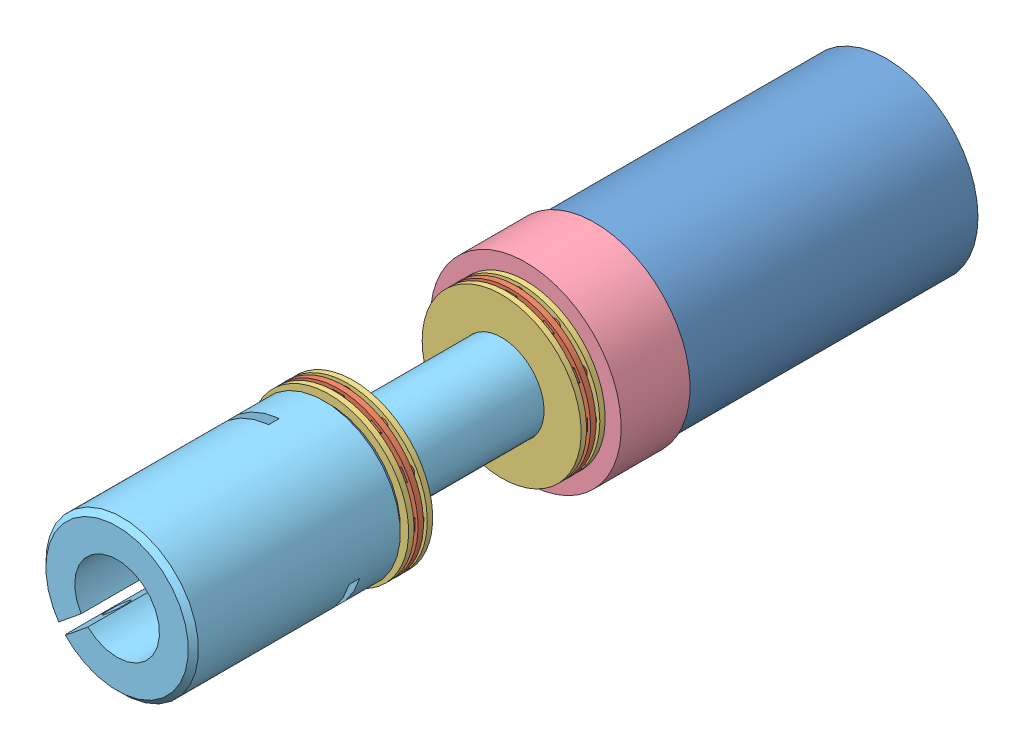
SolidWorks assembly FLA121-00.SLDASM, configuration Default (file format 5000). Lengths in mm.
Overall size (32.17 32.17 864.49).
10 component instances, 6 part files, 18 mates.
Components (placement in the parent):
- MCM98940A204-30.5-1: MCM98940A204-30.5.SLDPRT [Default] at (-70.4699 27.4116 -127.487) size (12.7 12.7 774.7)
- MSC354070__-1: MSC354070__.SLDPRT [Default] at (-70.4699 27.4116 -217.276) size (27.43 27.43 43.69)
- MSC03380904-1: MSC03380904.SLDPRT [Default] at (-70.4699 27.4116 -161.8786) size (23.83 23.83 2.09)
- MSC03380904-2: MSC03380904.SLDPRT [Default] at (-70.4699 27.4116 -136.0468) size (23.83 23.83 2.09)
- MSC03381076-1: MSC03381076.SLDPRT [Default] at (-70.4699 27.4116 -137.4438) size (23.8 23.8 0.81)
- MSC03381076-2: MSC03381076.SLDPRT [Default] at (-70.4699 27.4116 -134.6498) size (23.8 23.8 0.81)
- MSC03381076-3: MSC03381076.SLDPRT [Default] at (-70.4699 27.4116 -160.4816) size (23.8 23.8 0.81)
- MSC03381076-4: MSC03381076.SLDPRT [Default] at (-70.4699 27.4116 -163.2756) size (23.8 23.8 0.81)
- MSC87856779-1: MSC87856779.SLDPRT [Default] at (-70.4699 27.4116 -173.588) size (28.57 28.57 10.31)
- CRP100-02-1: CRP100-02.SLDPRT [Default] at (-70.4699 27.4116 -133.837) x (-0.773928 -0.633273 0) z (0 0 1) size (22.86 22.86 82.55)
Mates (geometry in assembly coordinates):
- Coincident2: coincident anti-aligned: plane of MSC354070__-1 through (-70.4699 27.4116 -173.588) normal (0 0 1); plane of MSC87856779-1 through (-70.4699 27.4116 -173.588) normal (0 0 -1)
- Coincident3: coincident anti-aligned: plane of MSC03381076-4 through (-70.4699 27.4116 -163.2756) normal (0 0 -1); plane of MSC87856779-1 through (-70.4699 27.4116 -163.2756) normal (0 0 1)
- Distance1: distance = 22.225 mm anti-aligned: plane of MSC03381076-1 through (-70.4699 27.4116 -137.4438) normal (0 0 -1); plane of MSC03381076-3 through (-70.4699 27.4116 -159.6688) normal (0 0 1)
- Tangent1: tangent anti-aligned: cylinder of MSC03380904-1 through (-80.3686 33.1266 -161.4722) axis (0.866025 -0.5 0) radius 0.9906; plane of MSC03381076-4 through (-70.4699 27.4116 -162.4628) normal (0 0 1)
- Tangent2: tangent anti-aligned: cylinder of MSC03380904-1 through (-76.1849 37.3103 -161.4722) axis (0.5 -0.866025 0) radius 0.9906; plane of MSC03381076-3 through (-70.4699 27.4116 -160.4816) normal (0 0 -1)
- Tangent3: tangent anti-aligned: cylinder of MSC03380904-2 through (-80.3686 33.1266 -135.6404) axis (0.866025 -0.5 0) radius 0.9906; plane of MSC03381076-2 through (-70.4699 27.4116 -134.6498) normal (0 0 -1)
- Tangent4: tangent anti-aligned: cylinder of MSC03380904-2 through (-80.3686 33.1266 -135.6404) axis (0.866025 -0.5 0) radius 0.9906; plane of MSC03381076-1 through (-70.4699 27.4116 -136.631) normal (0 0 1)
- Coincident4: coincident aligned: circle of MCM98940A204-30.5-1; plane of CRP100-02-1 through (-70.4699 27.4116 -127.487) normal (0 0 1)
- Concentric1: concentric anti-aligned: cylinder of MCM98940A204-30.5-1 through (-70.4699 27.4116 647.213) axis (0 0 -1) radius 6.35; cylinder of CRP100-02-1 through (-70.4699 27.4116 -127.487) axis (0 0 1) radius 6.35
- Coincident5: coincident anti-aligned: plane of MSC03381076-2 through (-70.4699 27.4116 -133.837) normal (0 0 1); plane of CRP100-02-1 through (-70.4699 27.4116 -133.837) normal (0 0 -1)
- Concentric2: concentric anti-aligned: cylinder of CRP100-02-1 through (-70.4699 27.4116 -184.637) axis (0 0 1) radius 6.35; cylinder of MSC03381076-2 through (-70.4699 27.4116 -133.837) axis (0 0 -1) radius 6.35
- Concentric3: concentric anti-aligned: cylinder of CRP100-02-1 through (-70.4699 27.4116 -184.637) axis (0 0 1) radius 6.35; cylinder of MSC03381076-1 through (-70.4699 27.4116 -136.631) axis (0 0 -1) radius 6.35
- Concentric4: concentric anti-aligned: cylinder of CRP100-02-1 through (-70.4699 27.4116 -184.637) axis (0 0 1) radius 6.35; cylinder of MSC03380904-1 through (-70.4699 27.4116 -161.0658) axis (0 0 -1) radius 6.3754
- Concentric5: concentric anti-aligned: cylinder of CRP100-02-1 through (-70.4699 27.4116 -184.637) axis (0 0 1) radius 6.35; cylinder of MSC87856779-1 through (-70.4699 27.4116 -163.2756) axis (0 0 -1) radius 6.35
- Concentric6: concentric anti-aligned: cylinder of CRP100-02-1 through (-70.4699 27.4116 -184.637) axis (0 0 1) radius 6.35; cylinder of MSC03380904-2 through (-70.4699 27.4116 -135.234) axis (0 0 -1) radius 6.3754
- Concentric7: concentric anti-aligned: cylinder of CRP100-02-1 through (-70.4699 27.4116 -184.637) axis (0 0 1) radius 6.35; cylinder of MSC03381076-3 through (-70.4699 27.4116 -159.6688) axis (0 0 -1) radius 6.35
- Concentric8: concentric aligned: cylinder of CRP100-02-1 through (-70.4699 27.4116 -184.637) axis (0 0 1) radius 6.35; circle of MSC03381076-4
- Concentric9: concentric anti-aligned: cylinder of CRP100-02-1 through (-70.4699 27.4116 -184.637) axis (0 0 1) radius 6.35; cylinder of MSC354070__-1 through (-70.4699 27.4116 -198.226) axis (0 0 -1) radius 4.7625
